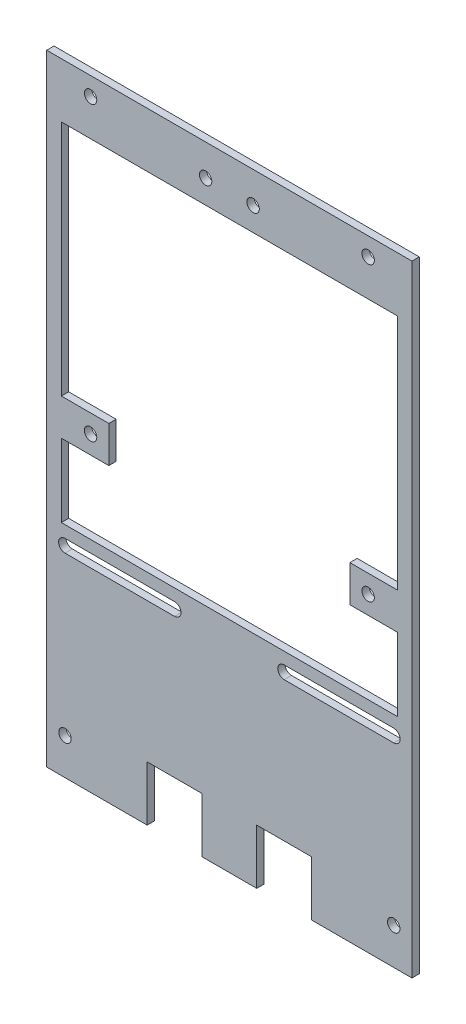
ISO-10303-21;
HEADER;
FILE_DESCRIPTION(('STEP AP214'),'2;1');
FILE_NAME('part.step','',(''),(''),'','','');
FILE_SCHEMA(('AUTOMOTIVE_DESIGN { 1 0 10303 214 1 1 1 1 }'));
ENDSEC;
DATA;
#1=APPLICATION_CONTEXT('core data for automotive mechanical design processes');
#2=APPLICATION_PROTOCOL_DEFINITION('international standard','automotive_design',2000,#1);
#3=PRODUCT_CONTEXT('',#1,'mechanical');
#4=PRODUCT('Part','Part','',(#3));
#5=PRODUCT_RELATED_PRODUCT_CATEGORY('part','',(#4));
#6=PRODUCT_DEFINITION_FORMATION('','',#4);
#7=PRODUCT_DEFINITION_CONTEXT('part definition',#1,'design');
#8=PRODUCT_DEFINITION('design','',#6,#7);
#9=PRODUCT_DEFINITION_SHAPE('','',#8);
#10=(LENGTH_UNIT() NAMED_UNIT(*) SI_UNIT(.MILLI.,.METRE.));
#11=(NAMED_UNIT(*) PLANE_ANGLE_UNIT() SI_UNIT($,.RADIAN.));
#12=(NAMED_UNIT(*) SI_UNIT($,.STERADIAN.) SOLID_ANGLE_UNIT());
#13=UNCERTAINTY_MEASURE_WITH_UNIT(LENGTH_MEASURE(1.E-05),#10,'distance_accuracy_value','');
#14=(GEOMETRIC_REPRESENTATION_CONTEXT(3) GLOBAL_UNCERTAINTY_ASSIGNED_CONTEXT((#13)) GLOBAL_UNIT_ASSIGNED_CONTEXT((#10,
#11,#12)) REPRESENTATION_CONTEXT('',''));
#15=CARTESIAN_POINT('',(0.,0.,0.));
#16=DIRECTION('',(0.,0.,1.));
#17=DIRECTION('',(1.,0.,0.));
#18=AXIS2_PLACEMENT_3D('',#15,#16,#17);
#19=CARTESIAN_POINT('',(0.,0.,2.));
#20=DIRECTION('',(0.,0.,1.));
#21=DIRECTION('',(1.,0.,0.));
#22=AXIS2_PLACEMENT_3D('',#19,#20,#21);
#23=PLANE('',#22);
#24=CARTESIAN_POINT('',(15.,-30.,2.));
#25=DIRECTION('',(0.,0.,1.));
#26=DIRECTION('',(1.,0.,0.));
#27=AXIS2_PLACEMENT_3D('',#24,#25,#26);
#28=CIRCLE('',#27,1.75);
#29=CARTESIAN_POINT('',(15.,-28.2500000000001,2.));
#30=VERTEX_POINT('',#29);
#31=CARTESIAN_POINT('',(15.,-31.75,2.));
#32=VERTEX_POINT('',#31);
#33=EDGE_CURVE('E50',#30,#32,#28,.T.);
#34=ORIENTED_EDGE('',*,*,#33,.F.);
#35=DIRECTION('',(-1.,0.,0.));
#36=VECTOR('',#35,1.);
#37=CARTESIAN_POINT('',(15.,-28.2500000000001,2.));
#38=LINE('',#37,#36);
#39=CARTESIAN_POINT('',(45.,-28.25,2.));
#40=VERTEX_POINT('',#39);
#41=EDGE_CURVE('E252',#40,#30,#38,.T.);
#42=ORIENTED_EDGE('',*,*,#41,.F.);
#43=CARTESIAN_POINT('',(45.,-30.0000000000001,2.));
#44=DIRECTION('',(0.,0.,1.));
#45=DIRECTION('',(1.,0.,0.));
#46=AXIS2_PLACEMENT_3D('',#43,#44,#45);
#47=CIRCLE('',#46,1.75);
#48=CARTESIAN_POINT('',(45.,-31.7500000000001,2.));
#49=VERTEX_POINT('',#48);
#50=EDGE_CURVE('E272',#49,#40,#47,.T.);
#51=ORIENTED_EDGE('',*,*,#50,.F.);
#52=DIRECTION('',(1.,0.,0.));
#53=VECTOR('',#52,1.);
#54=CARTESIAN_POINT('',(15.,-31.75,2.));
#55=LINE('',#54,#53);
#56=EDGE_CURVE('E266',#32,#49,#55,.T.);
#57=ORIENTED_EDGE('',*,*,#56,.F.);
#58=EDGE_LOOP('',(#34,#42,#51,#57));
#59=FACE_BOUND('',#58,.T.);
#60=CARTESIAN_POINT('',(-45.,-30.0000000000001,2.));
#61=DIRECTION('',(0.,0.,1.));
#62=DIRECTION('',(1.,0.,0.));
#63=AXIS2_PLACEMENT_3D('',#60,#61,#62);
#64=CIRCLE('',#63,1.75);
#65=CARTESIAN_POINT('',(-45.,-28.2500000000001,2.));
#66=VERTEX_POINT('',#65);
#67=CARTESIAN_POINT('',(-45.,-31.75,2.));
#68=VERTEX_POINT('',#67);
#69=EDGE_CURVE('E288',#66,#68,#64,.T.);
#70=ORIENTED_EDGE('',*,*,#69,.F.);
#71=DIRECTION('',(-1.,0.,0.));
#72=VECTOR('',#71,1.);
#73=CARTESIAN_POINT('',(-45.,-28.2500000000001,2.));
#74=LINE('',#73,#72);
#75=CARTESIAN_POINT('',(-15.,-28.25,2.));
#76=VERTEX_POINT('',#75);
#77=EDGE_CURVE('E296',#76,#66,#74,.T.);
#78=ORIENTED_EDGE('',*,*,#77,.F.);
#79=CARTESIAN_POINT('',(-15.,-30.,2.));
#80=DIRECTION('',(0.,0.,1.));
#81=DIRECTION('',(1.,0.,0.));
#82=AXIS2_PLACEMENT_3D('',#79,#80,#81);
#83=CIRCLE('',#82,1.75);
#84=CARTESIAN_POINT('',(-15.,-31.7500000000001,2.));
#85=VERTEX_POINT('',#84);
#86=EDGE_CURVE('E293',#85,#76,#83,.T.);
#87=ORIENTED_EDGE('',*,*,#86,.F.);
#88=DIRECTION('',(1.,0.,0.));
#89=VECTOR('',#88,1.);
#90=CARTESIAN_POINT('',(-45.,-31.75,2.));
#91=LINE('',#90,#89);
#92=EDGE_CURVE('E290',#68,#85,#91,.T.);
#93=ORIENTED_EDGE('',*,*,#92,.F.);
#94=EDGE_LOOP('',(#70,#78,#87,#93));
#95=FACE_BOUND('',#94,.T.);
#96=CARTESIAN_POINT('',(-38.,80.,2.));
#97=DIRECTION('',(0.,0.,1.));
#98=DIRECTION('',(1.,0.,0.));
#99=AXIS2_PLACEMENT_3D('',#96,#97,#98);
#100=CIRCLE('',#99,1.69999999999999);
#101=CARTESIAN_POINT('',(-36.3,80.,2.));
#102=VERTEX_POINT('',#101);
#103=EDGE_CURVE('E401',#102,#102,#100,.T.);
#104=ORIENTED_EDGE('',*,*,#103,.F.);
#105=EDGE_LOOP('',(#104));
#106=FACE_BOUND('',#105,.T.);
#107=CARTESIAN_POINT('',(38.,80.,2.));
#108=DIRECTION('',(0.,0.,1.));
#109=DIRECTION('',(1.,0.,0.));
#110=AXIS2_PLACEMENT_3D('',#107,#108,#109);
#111=CIRCLE('',#110,1.69999999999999);
#112=CARTESIAN_POINT('',(39.7,80.,2.));
#113=VERTEX_POINT('',#112);
#114=EDGE_CURVE('E407',#113,#113,#111,.T.);
#115=ORIENTED_EDGE('',*,*,#114,.F.);
#116=EDGE_LOOP('',(#115));
#117=FACE_BOUND('',#116,.T.);
#118=CARTESIAN_POINT('',(-38.,0.,2.));
#119=DIRECTION('',(0.,0.,1.));
#120=DIRECTION('',(1.,0.,0.));
#121=AXIS2_PLACEMENT_3D('',#118,#119,#120);
#122=CIRCLE('',#121,1.69999999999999);
#123=CARTESIAN_POINT('',(-36.3,0.,2.));
#124=VERTEX_POINT('',#123);
#125=EDGE_CURVE('E413',#124,#124,#122,.T.);
#126=ORIENTED_EDGE('',*,*,#125,.F.);
#127=EDGE_LOOP('',(#126));
#128=FACE_BOUND('',#127,.T.);
#129=CARTESIAN_POINT('',(38.,0.,2.));
#130=DIRECTION('',(0.,0.,1.));
#131=DIRECTION('',(1.,0.,0.));
#132=AXIS2_PLACEMENT_3D('',#129,#130,#131);
#133=CIRCLE('',#132,1.69999999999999);
#134=CARTESIAN_POINT('',(39.7,0.,2.));
#135=VERTEX_POINT('',#134);
#136=EDGE_CURVE('E419',#135,#135,#133,.T.);
#137=ORIENTED_EDGE('',*,*,#136,.F.);
#138=EDGE_LOOP('',(#137));
#139=FACE_BOUND('',#138,.T.);
#140=CARTESIAN_POINT('',(-45.,-75.,2.));
#141=DIRECTION('',(0.,0.,1.));
#142=DIRECTION('',(1.,0.,0.));
#143=AXIS2_PLACEMENT_3D('',#140,#141,#142);
#144=CIRCLE('',#143,1.69999999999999);
#145=CARTESIAN_POINT('',(-43.3,-75.,2.));
#146=VERTEX_POINT('',#145);
#147=EDGE_CURVE('E425',#146,#146,#144,.T.);
#148=ORIENTED_EDGE('',*,*,#147,.F.);
#149=EDGE_LOOP('',(#148));
#150=FACE_BOUND('',#149,.T.);
#151=CARTESIAN_POINT('',(45.,-75.,2.));
#152=DIRECTION('',(0.,0.,1.));
#153=DIRECTION('',(1.,0.,0.));
#154=AXIS2_PLACEMENT_3D('',#151,#152,#153);
#155=CIRCLE('',#154,1.69999999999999);
#156=CARTESIAN_POINT('',(46.7,-75.,2.));
#157=VERTEX_POINT('',#156);
#158=EDGE_CURVE('E431',#157,#157,#155,.T.);
#159=ORIENTED_EDGE('',*,*,#158,.F.);
#160=EDGE_LOOP('',(#159));
#161=FACE_BOUND('',#160,.T.);
#162=CARTESIAN_POINT('',(-6.49999121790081,76.4436388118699,2.));
#163=DIRECTION('',(0.,0.,1.));
#164=DIRECTION('',(1.,0.,0.));
#165=AXIS2_PLACEMENT_3D('',#162,#163,#164);
#166=CIRCLE('',#165,1.69999999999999);
#167=CARTESIAN_POINT('',(-4.79999121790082,76.4436388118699,2.));
#168=VERTEX_POINT('',#167);
#169=EDGE_CURVE('E437',#168,#168,#166,.T.);
#170=ORIENTED_EDGE('',*,*,#169,.F.);
#171=EDGE_LOOP('',(#170));
#172=FACE_BOUND('',#171,.T.);
#173=CARTESIAN_POINT('',(6.50000878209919,76.4436388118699,2.));
#174=DIRECTION('',(0.,0.,1.));
#175=DIRECTION('',(1.,0.,0.));
#176=AXIS2_PLACEMENT_3D('',#173,#174,#175);
#177=CIRCLE('',#176,1.69999999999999);
#178=CARTESIAN_POINT('',(8.20000878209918,76.4436388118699,2.));
#179=VERTEX_POINT('',#178);
#180=EDGE_CURVE('E443',#179,#179,#177,.T.);
#181=ORIENTED_EDGE('',*,*,#180,.F.);
#182=EDGE_LOOP('',(#181));
#183=FACE_BOUND('',#182,.T.);
#184=DIRECTION('',(0.,1.,0.));
#185=VECTOR('',#184,1.);
#186=CARTESIAN_POINT('',(22.5,-100.,2.));
#187=LINE('',#186,#185);
#188=CARTESIAN_POINT('',(22.5,-85.,2.));
#189=VERTEX_POINT('',#188);
#190=CARTESIAN_POINT('',(22.5,-70.,2.));
#191=VERTEX_POINT('',#190);
#192=EDGE_CURVE('E449',#189,#191,#187,.T.);
#193=ORIENTED_EDGE('',*,*,#192,.F.);
#194=DIRECTION('',(1.,0.,0.));
#195=VECTOR('',#194,1.);
#196=CARTESIAN_POINT('',(-50.,-85.,2.));
#197=LINE('',#196,#195);
#198=CARTESIAN_POINT('',(50.,-85.,2.));
#199=VERTEX_POINT('',#198);
#200=EDGE_CURVE('E494',#189,#199,#197,.T.);
#201=ORIENTED_EDGE('',*,*,#200,.T.);
#202=DIRECTION('',(0.,1.,0.));
#203=VECTOR('',#202,1.);
#204=CARTESIAN_POINT('',(50.,85.,2.));
#205=LINE('',#204,#203);
#206=CARTESIAN_POINT('',(50.,85.,2.));
#207=VERTEX_POINT('',#206);
#208=EDGE_CURVE('E486',#199,#207,#205,.T.);
#209=ORIENTED_EDGE('',*,*,#208,.T.);
#210=DIRECTION('',(-1.,0.,0.));
#211=VECTOR('',#210,1.);
#212=CARTESIAN_POINT('',(-50.,85.,2.));
#213=LINE('',#212,#211);
#214=CARTESIAN_POINT('',(-50.,85.,2.));
#215=VERTEX_POINT('',#214);
#216=EDGE_CURVE('E489',#207,#215,#213,.T.);
#217=ORIENTED_EDGE('',*,*,#216,.T.);
#218=DIRECTION('',(0.,-1.,0.));
#219=VECTOR('',#218,1.);
#220=CARTESIAN_POINT('',(-50.,85.,2.));
#221=LINE('',#220,#219);
#222=CARTESIAN_POINT('',(-50.,-85.,2.));
#223=VERTEX_POINT('',#222);
#224=EDGE_CURVE('E492',#215,#223,#221,.T.);
#225=ORIENTED_EDGE('',*,*,#224,.T.);
#226=CARTESIAN_POINT('',(-22.5,-85.,2.));
#227=VERTEX_POINT('',#226);
#228=EDGE_CURVE('E495',#223,#227,#197,.T.);
#229=ORIENTED_EDGE('',*,*,#228,.T.);
#230=DIRECTION('',(0.,-1.,0.));
#231=VECTOR('',#230,1.);
#232=CARTESIAN_POINT('',(-22.5,-100.,2.));
#233=LINE('',#232,#231);
#234=CARTESIAN_POINT('',(-22.5,-70.,2.));
#235=VERTEX_POINT('',#234);
#236=EDGE_CURVE('E472',#235,#227,#233,.T.);
#237=ORIENTED_EDGE('',*,*,#236,.F.);
#238=DIRECTION('',(-1.,0.,0.));
#239=VECTOR('',#238,1.);
#240=CARTESIAN_POINT('',(-22.5,-70.,2.));
#241=LINE('',#240,#239);
#242=CARTESIAN_POINT('',(-7.5,-70.,2.));
#243=VERTEX_POINT('',#242);
#244=EDGE_CURVE('E469',#243,#235,#241,.T.);
#245=ORIENTED_EDGE('',*,*,#244,.F.);
#246=DIRECTION('',(0.,1.,0.));
#247=VECTOR('',#246,1.);
#248=CARTESIAN_POINT('',(-7.5,-100.,2.));
#249=LINE('',#248,#247);
#250=CARTESIAN_POINT('',(-7.5,-85.,2.));
#251=VERTEX_POINT('',#250);
#252=EDGE_CURVE('E467',#251,#243,#249,.T.);
#253=ORIENTED_EDGE('',*,*,#252,.F.);
#254=CARTESIAN_POINT('',(7.5,-85.,2.));
#255=VERTEX_POINT('',#254);
#256=EDGE_CURVE('E499',#251,#255,#197,.T.);
#257=ORIENTED_EDGE('',*,*,#256,.T.);
#258=DIRECTION('',(0.,-1.,0.));
#259=VECTOR('',#258,1.);
#260=CARTESIAN_POINT('',(7.5,-100.,2.));
#261=LINE('',#260,#259);
#262=CARTESIAN_POINT('',(7.5,-70.,2.));
#263=VERTEX_POINT('',#262);
#264=EDGE_CURVE('E454',#263,#255,#261,.T.);
#265=ORIENTED_EDGE('',*,*,#264,.F.);
#266=DIRECTION('',(-1.,0.,0.));
#267=VECTOR('',#266,1.);
#268=CARTESIAN_POINT('',(7.5,-70.,2.));
#269=LINE('',#268,#267);
#270=EDGE_CURVE('E451',#191,#263,#269,.T.);
#271=ORIENTED_EDGE('',*,*,#270,.F.);
#272=EDGE_LOOP('',(#193,#201,#209,#217,#225,#229,#237,#245,#253,#257,#265,#271));
#273=FACE_BOUND('',#272,.T.);
#274=DIRECTION('',(1.,0.,0.));
#275=VECTOR('',#274,1.);
#276=CARTESIAN_POINT('',(0.,70.,2.));
#277=LINE('',#276,#275);
#278=CARTESIAN_POINT('',(-46.,70.,2.));
#279=VERTEX_POINT('',#278);
#280=CARTESIAN_POINT('',(46.,70.,2.));
#281=VERTEX_POINT('',#280);
#282=EDGE_CURVE('E342',#279,#281,#277,.T.);
#283=ORIENTED_EDGE('',*,*,#282,.T.);
#284=DIRECTION('',(0.,-1.,0.));
#285=VECTOR('',#284,1.);
#286=CARTESIAN_POINT('',(46.,0.,2.));
#287=LINE('',#286,#285);
#288=CARTESIAN_POINT('',(46.,4.99999999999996,2.));
#289=VERTEX_POINT('',#288);
#290=EDGE_CURVE('E339',#281,#289,#287,.T.);
#291=ORIENTED_EDGE('',*,*,#290,.T.);
#292=DIRECTION('',(1.,0.,0.));
#293=VECTOR('',#292,1.);
#294=CARTESIAN_POINT('',(0.,4.99999999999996,2.));
#295=LINE('',#294,#293);
#296=CARTESIAN_POINT('',(33.,4.99999999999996,2.));
#297=VERTEX_POINT('',#296);
#298=EDGE_CURVE('E352',#297,#289,#295,.T.);
#299=ORIENTED_EDGE('',*,*,#298,.F.);
#300=DIRECTION('',(0.,-1.,0.));
#301=VECTOR('',#300,1.);
#302=CARTESIAN_POINT('',(33.,0.,2.));
#303=LINE('',#302,#301);
#304=CARTESIAN_POINT('',(33.,-5.00000000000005,2.));
#305=VERTEX_POINT('',#304);
#306=EDGE_CURVE('E370',#297,#305,#303,.T.);
#307=ORIENTED_EDGE('',*,*,#306,.T.);
#308=DIRECTION('',(1.,0.,0.));
#309=VECTOR('',#308,1.);
#310=CARTESIAN_POINT('',(0.,-5.00000000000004,2.));
#311=LINE('',#310,#309);
#312=CARTESIAN_POINT('',(46.,-5.00000000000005,2.));
#313=VERTEX_POINT('',#312);
#314=EDGE_CURVE('E367',#305,#313,#311,.T.);
#315=ORIENTED_EDGE('',*,*,#314,.T.);
#316=DIRECTION('',(0.,-1.,0.));
#317=VECTOR('',#316,1.);
#318=CARTESIAN_POINT('',(46.,0.,2.));
#319=LINE('',#318,#317);
#320=CARTESIAN_POINT('',(46.,-25.,2.));
#321=VERTEX_POINT('',#320);
#322=EDGE_CURVE('E364',#313,#321,#319,.T.);
#323=ORIENTED_EDGE('',*,*,#322,.T.);
#324=DIRECTION('',(1.,0.,0.));
#325=VECTOR('',#324,1.);
#326=CARTESIAN_POINT('',(0.,-25.,2.));
#327=LINE('',#326,#325);
#328=CARTESIAN_POINT('',(-46.,-25.,2.));
#329=VERTEX_POINT('',#328);
#330=EDGE_CURVE('E361',#329,#321,#327,.T.);
#331=ORIENTED_EDGE('',*,*,#330,.F.);
#332=DIRECTION('',(0.,-1.,0.));
#333=VECTOR('',#332,1.);
#334=CARTESIAN_POINT('',(-46.,0.,2.));
#335=LINE('',#334,#333);
#336=CARTESIAN_POINT('',(-46.,-5.00000000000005,2.));
#337=VERTEX_POINT('',#336);
#338=EDGE_CURVE('E358',#337,#329,#335,.T.);
#339=ORIENTED_EDGE('',*,*,#338,.F.);
#340=DIRECTION('',(1.,0.,0.));
#341=VECTOR('',#340,1.);
#342=CARTESIAN_POINT('',(0.,-5.00000000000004,2.));
#343=LINE('',#342,#341);
#344=CARTESIAN_POINT('',(-33.,-5.00000000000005,2.));
#345=VERTEX_POINT('',#344);
#346=EDGE_CURVE('E355',#337,#345,#343,.T.);
#347=ORIENTED_EDGE('',*,*,#346,.T.);
#348=DIRECTION('',(0.,-1.,0.));
#349=VECTOR('',#348,1.);
#350=CARTESIAN_POINT('',(-33.,0.,2.));
#351=LINE('',#350,#349);
#352=CARTESIAN_POINT('',(-33.,4.99999999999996,2.));
#353=VERTEX_POINT('',#352);
#354=EDGE_CURVE('E351',#353,#345,#351,.T.);
#355=ORIENTED_EDGE('',*,*,#354,.F.);
#356=CARTESIAN_POINT('',(-46.,4.99999999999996,2.));
#357=VERTEX_POINT('',#356);
#358=EDGE_CURVE('E348',#357,#353,#295,.T.);
#359=ORIENTED_EDGE('',*,*,#358,.F.);
#360=DIRECTION('',(0.,-1.,0.));
#361=VECTOR('',#360,1.);
#362=CARTESIAN_POINT('',(-46.,0.,2.));
#363=LINE('',#362,#361);
#364=EDGE_CURVE('E345',#279,#357,#363,.T.);
#365=ORIENTED_EDGE('',*,*,#364,.F.);
#366=EDGE_LOOP('',(#283,#291,#299,#307,#315,#323,#331,#339,#347,#355,#359,#365));
#367=FACE_BOUND('',#366,.T.);
#368=ADVANCED_FACE('F35',(#59,#95,#106,#117,#128,#139,#150,#161,#172,#183,#273,#367),#23,.T.);
#369=CARTESIAN_POINT('',(0.,0.,0.));
#370=DIRECTION('',(0.,0.,1.));
#371=DIRECTION('',(1.,0.,0.));
#372=AXIS2_PLACEMENT_3D('',#369,#370,#371);
#373=PLANE('',#372);
#374=DIRECTION('',(1.,0.,0.));
#375=VECTOR('',#374,1.);
#376=CARTESIAN_POINT('',(15.,-28.2500000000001,0.));
#377=LINE('',#376,#375);
#378=CARTESIAN_POINT('',(15.,-28.2500000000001,0.));
#379=VERTEX_POINT('',#378);
#380=CARTESIAN_POINT('',(45.,-28.25,0.));
#381=VERTEX_POINT('',#380);
#382=EDGE_CURVE('E264',#379,#381,#377,.T.);
#383=ORIENTED_EDGE('',*,*,#382,.F.);
#384=CARTESIAN_POINT('',(15.,-30.,0.));
#385=DIRECTION('',(0.,0.,1.));
#386=DIRECTION('',(1.,0.,0.));
#387=AXIS2_PLACEMENT_3D('',#384,#385,#386);
#388=CIRCLE('',#387,1.75);
#389=CARTESIAN_POINT('',(15.,-31.75,0.));
#390=VERTEX_POINT('',#389);
#391=EDGE_CURVE('E246',#390,#379,#388,.F.);
#392=ORIENTED_EDGE('',*,*,#391,.F.);
#393=DIRECTION('',(-1.,0.,0.));
#394=VECTOR('',#393,1.);
#395=CARTESIAN_POINT('',(15.,-31.75,0.));
#396=LINE('',#395,#394);
#397=CARTESIAN_POINT('',(45.,-31.7500000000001,0.));
#398=VERTEX_POINT('',#397);
#399=EDGE_CURVE('E255',#398,#390,#396,.T.);
#400=ORIENTED_EDGE('',*,*,#399,.F.);
#401=CARTESIAN_POINT('',(45.,-30.0000000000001,0.));
#402=DIRECTION('',(0.,0.,1.));
#403=DIRECTION('',(1.,0.,0.));
#404=AXIS2_PLACEMENT_3D('',#401,#402,#403);
#405=CIRCLE('',#404,1.75);
#406=EDGE_CURVE('E58',#381,#398,#405,.F.);
#407=ORIENTED_EDGE('',*,*,#406,.F.);
#408=EDGE_LOOP('',(#383,#392,#400,#407));
#409=FACE_BOUND('',#408,.T.);
#410=DIRECTION('',(1.,0.,0.));
#411=VECTOR('',#410,1.);
#412=CARTESIAN_POINT('',(-45.,-28.2500000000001,0.));
#413=LINE('',#412,#411);
#414=CARTESIAN_POINT('',(-45.,-28.2500000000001,0.));
#415=VERTEX_POINT('',#414);
#416=CARTESIAN_POINT('',(-15.,-28.25,0.));
#417=VERTEX_POINT('',#416);
#418=EDGE_CURVE('E282',#415,#417,#413,.T.);
#419=ORIENTED_EDGE('',*,*,#418,.F.);
#420=CARTESIAN_POINT('',(-45.,-30.0000000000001,0.));
#421=DIRECTION('',(0.,0.,1.));
#422=DIRECTION('',(1.,0.,0.));
#423=AXIS2_PLACEMENT_3D('',#420,#421,#422);
#424=CIRCLE('',#423,1.75);
#425=CARTESIAN_POINT('',(-45.,-31.75,0.));
#426=VERTEX_POINT('',#425);
#427=EDGE_CURVE('E285',#426,#415,#424,.F.);
#428=ORIENTED_EDGE('',*,*,#427,.F.);
#429=DIRECTION('',(-1.,0.,0.));
#430=VECTOR('',#429,1.);
#431=CARTESIAN_POINT('',(-45.,-31.75,0.));
#432=LINE('',#431,#430);
#433=CARTESIAN_POINT('',(-15.,-31.7500000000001,0.));
#434=VERTEX_POINT('',#433);
#435=EDGE_CURVE('E302',#434,#426,#432,.T.);
#436=ORIENTED_EDGE('',*,*,#435,.F.);
#437=CARTESIAN_POINT('',(-15.,-30.,0.));
#438=DIRECTION('',(0.,0.,1.));
#439=DIRECTION('',(1.,0.,0.));
#440=AXIS2_PLACEMENT_3D('',#437,#438,#439);
#441=CIRCLE('',#440,1.75);
#442=EDGE_CURVE('E258',#417,#434,#441,.F.);
#443=ORIENTED_EDGE('',*,*,#442,.F.);
#444=EDGE_LOOP('',(#419,#428,#436,#443));
#445=FACE_BOUND('',#444,.T.);
#446=DIRECTION('',(1.,0.,0.));
#447=VECTOR('',#446,1.);
#448=CARTESIAN_POINT('',(-50.,-85.,0.));
#449=LINE('',#448,#447);
#450=CARTESIAN_POINT('',(22.5,-85.,0.));
#451=VERTEX_POINT('',#450);
#452=CARTESIAN_POINT('',(50.,-85.,0.));
#453=VERTEX_POINT('',#452);
#454=EDGE_CURVE('E506',#451,#453,#449,.T.);
#455=ORIENTED_EDGE('',*,*,#454,.F.);
#456=DIRECTION('',(0.,1.,0.));
#457=VECTOR('',#456,1.);
#458=CARTESIAN_POINT('',(22.5,0.,0.));
#459=LINE('',#458,#457);
#460=CARTESIAN_POINT('',(22.5,-70.,0.));
#461=VERTEX_POINT('',#460);
#462=EDGE_CURVE('E11',#451,#461,#459,.T.);
#463=ORIENTED_EDGE('',*,*,#462,.T.);
#464=DIRECTION('',(-1.,0.,0.));
#465=VECTOR('',#464,1.);
#466=CARTESIAN_POINT('',(0.,-70.,0.));
#467=LINE('',#466,#465);
#468=CARTESIAN_POINT('',(7.5,-70.,0.));
#469=VERTEX_POINT('',#468);
#470=EDGE_CURVE('E530',#461,#469,#467,.T.);
#471=ORIENTED_EDGE('',*,*,#470,.T.);
#472=DIRECTION('',(0.,-1.,0.));
#473=VECTOR('',#472,1.);
#474=CARTESIAN_POINT('',(7.5,0.,0.));
#475=LINE('',#474,#473);
#476=CARTESIAN_POINT('',(7.5,-85.,0.));
#477=VERTEX_POINT('',#476);
#478=EDGE_CURVE('E43',#469,#477,#475,.T.);
#479=ORIENTED_EDGE('',*,*,#478,.T.);
#480=CARTESIAN_POINT('',(-7.5,-85.,0.));
#481=VERTEX_POINT('',#480);
#482=EDGE_CURVE('E509',#481,#477,#449,.T.);
#483=ORIENTED_EDGE('',*,*,#482,.F.);
#484=DIRECTION('',(0.,1.,0.));
#485=VECTOR('',#484,1.);
#486=CARTESIAN_POINT('',(-7.5,0.,0.));
#487=LINE('',#486,#485);
#488=CARTESIAN_POINT('',(-7.5,-70.,0.));
#489=VERTEX_POINT('',#488);
#490=EDGE_CURVE('E527',#481,#489,#487,.T.);
#491=ORIENTED_EDGE('',*,*,#490,.T.);
#492=DIRECTION('',(-1.,0.,0.));
#493=VECTOR('',#492,1.);
#494=CARTESIAN_POINT('',(0.,-70.,0.));
#495=LINE('',#494,#493);
#496=CARTESIAN_POINT('',(-22.5,-70.,0.));
#497=VERTEX_POINT('',#496);
#498=EDGE_CURVE('E521',#489,#497,#495,.T.);
#499=ORIENTED_EDGE('',*,*,#498,.T.);
#500=DIRECTION('',(0.,-1.,0.));
#501=VECTOR('',#500,1.);
#502=CARTESIAN_POINT('',(-22.5,0.,0.));
#503=LINE('',#502,#501);
#504=CARTESIAN_POINT('',(-22.5,-85.,0.));
#505=VERTEX_POINT('',#504);
#506=EDGE_CURVE('E524',#497,#505,#503,.T.);
#507=ORIENTED_EDGE('',*,*,#506,.T.);
#508=CARTESIAN_POINT('',(-50.,-85.,0.));
#509=VERTEX_POINT('',#508);
#510=EDGE_CURVE('E490',#509,#505,#449,.T.);
#511=ORIENTED_EDGE('',*,*,#510,.F.);
#512=DIRECTION('',(0.,-1.,0.));
#513=VECTOR('',#512,1.);
#514=CARTESIAN_POINT('',(-50.,85.,0.));
#515=LINE('',#514,#513);
#516=CARTESIAN_POINT('',(-50.,85.,0.));
#517=VERTEX_POINT('',#516);
#518=EDGE_CURVE('E504',#517,#509,#515,.T.);
#519=ORIENTED_EDGE('',*,*,#518,.F.);
#520=DIRECTION('',(-1.,0.,0.));
#521=VECTOR('',#520,1.);
#522=CARTESIAN_POINT('',(-50.,85.,0.));
#523=LINE('',#522,#521);
#524=CARTESIAN_POINT('',(50.,85.,0.));
#525=VERTEX_POINT('',#524);
#526=EDGE_CURVE('E502',#525,#517,#523,.T.);
#527=ORIENTED_EDGE('',*,*,#526,.F.);
#528=DIRECTION('',(0.,1.,0.));
#529=VECTOR('',#528,1.);
#530=CARTESIAN_POINT('',(50.,85.,0.));
#531=LINE('',#530,#529);
#532=EDGE_CURVE('E485',#453,#525,#531,.T.);
#533=ORIENTED_EDGE('',*,*,#532,.F.);
#534=EDGE_LOOP('',(#455,#463,#471,#479,#483,#491,#499,#507,#511,#519,#527,#533));
#535=FACE_BOUND('',#534,.T.);
#536=CARTESIAN_POINT('',(6.50000878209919,76.4436388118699,0.));
#537=DIRECTION('',(0.,0.,1.));
#538=DIRECTION('',(1.,0.,0.));
#539=AXIS2_PLACEMENT_3D('',#536,#537,#538);
#540=CIRCLE('',#539,1.7);
#541=CARTESIAN_POINT('',(8.20000878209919,76.4436388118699,0.));
#542=VERTEX_POINT('',#541);
#543=EDGE_CURVE('E446',#542,#542,#540,.T.);
#544=ORIENTED_EDGE('',*,*,#543,.T.);
#545=EDGE_LOOP('',(#544));
#546=FACE_BOUND('',#545,.T.);
#547=CARTESIAN_POINT('',(-6.49999121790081,76.4436388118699,0.));
#548=DIRECTION('',(0.,0.,1.));
#549=DIRECTION('',(1.,0.,0.));
#550=AXIS2_PLACEMENT_3D('',#547,#548,#549);
#551=CIRCLE('',#550,1.7);
#552=CARTESIAN_POINT('',(-4.79999121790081,76.4436388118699,0.));
#553=VERTEX_POINT('',#552);
#554=EDGE_CURVE('E440',#553,#553,#551,.T.);
#555=ORIENTED_EDGE('',*,*,#554,.T.);
#556=EDGE_LOOP('',(#555));
#557=FACE_BOUND('',#556,.T.);
#558=CARTESIAN_POINT('',(45.,-75.,0.));
#559=DIRECTION('',(0.,0.,1.));
#560=DIRECTION('',(1.,0.,0.));
#561=AXIS2_PLACEMENT_3D('',#558,#559,#560);
#562=CIRCLE('',#561,1.7);
#563=CARTESIAN_POINT('',(46.7,-75.,0.));
#564=VERTEX_POINT('',#563);
#565=EDGE_CURVE('E434',#564,#564,#562,.T.);
#566=ORIENTED_EDGE('',*,*,#565,.T.);
#567=EDGE_LOOP('',(#566));
#568=FACE_BOUND('',#567,.T.);
#569=CARTESIAN_POINT('',(-45.,-75.,0.));
#570=DIRECTION('',(0.,0.,1.));
#571=DIRECTION('',(1.,0.,0.));
#572=AXIS2_PLACEMENT_3D('',#569,#570,#571);
#573=CIRCLE('',#572,1.7);
#574=CARTESIAN_POINT('',(-43.3,-75.,0.));
#575=VERTEX_POINT('',#574);
#576=EDGE_CURVE('E428',#575,#575,#573,.T.);
#577=ORIENTED_EDGE('',*,*,#576,.T.);
#578=EDGE_LOOP('',(#577));
#579=FACE_BOUND('',#578,.T.);
#580=CARTESIAN_POINT('',(38.,0.,0.));
#581=DIRECTION('',(0.,0.,1.));
#582=DIRECTION('',(1.,0.,0.));
#583=AXIS2_PLACEMENT_3D('',#580,#581,#582);
#584=CIRCLE('',#583,1.7);
#585=CARTESIAN_POINT('',(39.7,0.,0.));
#586=VERTEX_POINT('',#585);
#587=EDGE_CURVE('E422',#586,#586,#584,.T.);
#588=ORIENTED_EDGE('',*,*,#587,.T.);
#589=EDGE_LOOP('',(#588));
#590=FACE_BOUND('',#589,.T.);
#591=CARTESIAN_POINT('',(-38.,0.,0.));
#592=DIRECTION('',(0.,0.,1.));
#593=DIRECTION('',(1.,0.,0.));
#594=AXIS2_PLACEMENT_3D('',#591,#592,#593);
#595=CIRCLE('',#594,1.7);
#596=CARTESIAN_POINT('',(-36.3,0.,0.));
#597=VERTEX_POINT('',#596);
#598=EDGE_CURVE('E416',#597,#597,#595,.T.);
#599=ORIENTED_EDGE('',*,*,#598,.T.);
#600=EDGE_LOOP('',(#599));
#601=FACE_BOUND('',#600,.T.);
#602=CARTESIAN_POINT('',(38.,80.,0.));
#603=DIRECTION('',(0.,0.,1.));
#604=DIRECTION('',(1.,0.,0.));
#605=AXIS2_PLACEMENT_3D('',#602,#603,#604);
#606=CIRCLE('',#605,1.7);
#607=CARTESIAN_POINT('',(39.7,80.,0.));
#608=VERTEX_POINT('',#607);
#609=EDGE_CURVE('E410',#608,#608,#606,.T.);
#610=ORIENTED_EDGE('',*,*,#609,.T.);
#611=EDGE_LOOP('',(#610));
#612=FACE_BOUND('',#611,.T.);
#613=CARTESIAN_POINT('',(-38.,80.,0.));
#614=DIRECTION('',(0.,0.,1.));
#615=DIRECTION('',(1.,0.,0.));
#616=AXIS2_PLACEMENT_3D('',#613,#614,#615);
#617=CIRCLE('',#616,1.7);
#618=CARTESIAN_POINT('',(-36.3,80.,0.));
#619=VERTEX_POINT('',#618);
#620=EDGE_CURVE('E404',#619,#619,#617,.T.);
#621=ORIENTED_EDGE('',*,*,#620,.T.);
#622=EDGE_LOOP('',(#621));
#623=FACE_BOUND('',#622,.T.);
#624=DIRECTION('',(0.,1.,0.));
#625=VECTOR('',#624,1.);
#626=CARTESIAN_POINT('',(46.,0.,0.));
#627=LINE('',#626,#625);
#628=CARTESIAN_POINT('',(46.,4.99999999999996,0.));
#629=VERTEX_POINT('',#628);
#630=CARTESIAN_POINT('',(46.,70.,0.));
#631=VERTEX_POINT('',#630);
#632=EDGE_CURVE('E336',#629,#631,#627,.T.);
#633=ORIENTED_EDGE('',*,*,#632,.T.);
#634=DIRECTION('',(-1.,0.,0.));
#635=VECTOR('',#634,1.);
#636=CARTESIAN_POINT('',(0.,70.,0.));
#637=LINE('',#636,#635);
#638=CARTESIAN_POINT('',(-46.,70.,0.));
#639=VERTEX_POINT('',#638);
#640=EDGE_CURVE('E375',#631,#639,#637,.T.);
#641=ORIENTED_EDGE('',*,*,#640,.T.);
#642=DIRECTION('',(0.,1.,0.));
#643=VECTOR('',#642,1.);
#644=CARTESIAN_POINT('',(-46.,0.,0.));
#645=LINE('',#644,#643);
#646=CARTESIAN_POINT('',(-46.,4.99999999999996,0.));
#647=VERTEX_POINT('',#646);
#648=EDGE_CURVE('E311',#647,#639,#645,.T.);
#649=ORIENTED_EDGE('',*,*,#648,.F.);
#650=DIRECTION('',(-1.,0.,0.));
#651=VECTOR('',#650,1.);
#652=CARTESIAN_POINT('',(0.,4.99999999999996,0.));
#653=LINE('',#652,#651);
#654=CARTESIAN_POINT('',(-33.,4.99999999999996,0.));
#655=VERTEX_POINT('',#654);
#656=EDGE_CURVE('E314',#655,#647,#653,.T.);
#657=ORIENTED_EDGE('',*,*,#656,.F.);
#658=DIRECTION('',(0.,1.,0.));
#659=VECTOR('',#658,1.);
#660=CARTESIAN_POINT('',(-33.,0.,0.));
#661=LINE('',#660,#659);
#662=CARTESIAN_POINT('',(-33.,-5.00000000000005,0.));
#663=VERTEX_POINT('',#662);
#664=EDGE_CURVE('E316',#663,#655,#661,.T.);
#665=ORIENTED_EDGE('',*,*,#664,.F.);
#666=DIRECTION('',(-1.,0.,0.));
#667=VECTOR('',#666,1.);
#668=CARTESIAN_POINT('',(0.,-5.00000000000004,0.));
#669=LINE('',#668,#667);
#670=CARTESIAN_POINT('',(-46.,-5.00000000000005,0.));
#671=VERTEX_POINT('',#670);
#672=EDGE_CURVE('E318',#663,#671,#669,.T.);
#673=ORIENTED_EDGE('',*,*,#672,.T.);
#674=DIRECTION('',(0.,1.,0.));
#675=VECTOR('',#674,1.);
#676=CARTESIAN_POINT('',(-46.,0.,0.));
#677=LINE('',#676,#675);
#678=CARTESIAN_POINT('',(-46.,-25.,0.));
#679=VERTEX_POINT('',#678);
#680=EDGE_CURVE('E321',#679,#671,#677,.T.);
#681=ORIENTED_EDGE('',*,*,#680,.F.);
#682=DIRECTION('',(-1.,0.,0.));
#683=VECTOR('',#682,1.);
#684=CARTESIAN_POINT('',(0.,-25.,0.));
#685=LINE('',#684,#683);
#686=CARTESIAN_POINT('',(46.,-25.,0.));
#687=VERTEX_POINT('',#686);
#688=EDGE_CURVE('E323',#687,#679,#685,.T.);
#689=ORIENTED_EDGE('',*,*,#688,.F.);
#690=DIRECTION('',(0.,1.,0.));
#691=VECTOR('',#690,1.);
#692=CARTESIAN_POINT('',(46.,0.,0.));
#693=LINE('',#692,#691);
#694=CARTESIAN_POINT('',(46.,-5.00000000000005,0.));
#695=VERTEX_POINT('',#694);
#696=EDGE_CURVE('E325',#687,#695,#693,.T.);
#697=ORIENTED_EDGE('',*,*,#696,.T.);
#698=DIRECTION('',(-1.,0.,0.));
#699=VECTOR('',#698,1.);
#700=CARTESIAN_POINT('',(0.,-5.00000000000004,0.));
#701=LINE('',#700,#699);
#702=CARTESIAN_POINT('',(33.,-5.00000000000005,0.));
#703=VERTEX_POINT('',#702);
#704=EDGE_CURVE('E328',#695,#703,#701,.T.);
#705=ORIENTED_EDGE('',*,*,#704,.T.);
#706=DIRECTION('',(0.,1.,0.));
#707=VECTOR('',#706,1.);
#708=CARTESIAN_POINT('',(33.,0.,0.));
#709=LINE('',#708,#707);
#710=CARTESIAN_POINT('',(33.,4.99999999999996,0.));
#711=VERTEX_POINT('',#710);
#712=EDGE_CURVE('E331',#703,#711,#709,.T.);
#713=ORIENTED_EDGE('',*,*,#712,.T.);
#714=DIRECTION('',(-1.,0.,0.));
#715=VECTOR('',#714,1.);
#716=CARTESIAN_POINT('',(0.,4.99999999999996,0.));
#717=LINE('',#716,#715);
#718=EDGE_CURVE('E334',#629,#711,#717,.T.);
#719=ORIENTED_EDGE('',*,*,#718,.F.);
#720=EDGE_LOOP('',(#633,#641,#649,#657,#665,#673,#681,#689,#697,#705,#713,#719));
#721=FACE_BOUND('',#720,.T.);
#722=ADVANCED_FACE('F261',(#409,#445,#535,#546,#557,#568,#579,#590,#601,#612,#623,#721),#373,.F.);
#723=CARTESIAN_POINT('',(-50.,-85.,2.));
#724=DIRECTION('',(0.,1.,0.));
#725=DIRECTION('',(0.,0.,1.));
#726=AXIS2_PLACEMENT_3D('',#723,#724,#725);
#727=PLANE('',#726);
#728=ORIENTED_EDGE('',*,*,#200,.F.);
#729=DIRECTION('',(0.,0.,-1.));
#730=VECTOR('',#729,1.);
#731=CARTESIAN_POINT('',(22.5,-85.,2.));
#732=LINE('',#731,#730);
#733=EDGE_CURVE('E464',#189,#451,#732,.T.);
#734=ORIENTED_EDGE('',*,*,#733,.T.);
#735=ORIENTED_EDGE('',*,*,#454,.T.);
#736=DIRECTION('',(0.,0.,-1.));
#737=VECTOR('',#736,1.);
#738=CARTESIAN_POINT('',(50.,-85.,2.));
#739=LINE('',#738,#737);
#740=EDGE_CURVE('E498',#199,#453,#739,.T.);
#741=ORIENTED_EDGE('',*,*,#740,.F.);
#742=EDGE_LOOP('',(#728,#734,#735,#741));
#743=FACE_BOUND('',#742,.T.);
#744=ADVANCED_FACE('F547',(#743),#727,.F.);
#745=ORIENTED_EDGE('',*,*,#482,.T.);
#746=DIRECTION('',(0.,0.,1.));
#747=VECTOR('',#746,1.);
#748=CARTESIAN_POINT('',(7.49999999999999,-85.,2.));
#749=LINE('',#748,#747);
#750=EDGE_CURVE('E459',#477,#255,#749,.T.);
#751=ORIENTED_EDGE('',*,*,#750,.T.);
#752=ORIENTED_EDGE('',*,*,#256,.F.);
#753=DIRECTION('',(0.,0.,-1.));
#754=VECTOR('',#753,1.);
#755=CARTESIAN_POINT('',(-7.50000000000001,-85.,2.));
#756=LINE('',#755,#754);
#757=EDGE_CURVE('E482',#251,#481,#756,.T.);
#758=ORIENTED_EDGE('',*,*,#757,.T.);
#759=EDGE_LOOP('',(#745,#751,#752,#758));
#760=FACE_BOUND('',#759,.T.);
#761=ADVANCED_FACE('F541',(#760),#727,.F.);
#762=CARTESIAN_POINT('',(50.,85.,2.));
#763=DIRECTION('',(-1.,0.,0.));
#764=DIRECTION('',(0.,-1.,0.));
#765=AXIS2_PLACEMENT_3D('',#762,#763,#764);
#766=PLANE('',#765);
#767=ORIENTED_EDGE('',*,*,#532,.T.);
#768=DIRECTION('',(0.,0.,-1.));
#769=VECTOR('',#768,1.);
#770=CARTESIAN_POINT('',(50.,85.,2.));
#771=LINE('',#770,#769);
#772=EDGE_CURVE('E518',#207,#525,#771,.T.);
#773=ORIENTED_EDGE('',*,*,#772,.F.);
#774=ORIENTED_EDGE('',*,*,#208,.F.);
#775=ORIENTED_EDGE('',*,*,#740,.T.);
#776=EDGE_LOOP('',(#767,#773,#774,#775));
#777=FACE_BOUND('',#776,.T.);
#778=ADVANCED_FACE('F37',(#777),#766,.F.);
#779=CARTESIAN_POINT('',(-50.,85.,2.));
#780=DIRECTION('',(0.,-1.,0.));
#781=DIRECTION('',(0.,0.,-1.));
#782=AXIS2_PLACEMENT_3D('',#779,#780,#781);
#783=PLANE('',#782);
#784=ORIENTED_EDGE('',*,*,#526,.T.);
#785=DIRECTION('',(0.,0.,-1.));
#786=VECTOR('',#785,1.);
#787=CARTESIAN_POINT('',(-50.,85.,2.));
#788=LINE('',#787,#786);
#789=EDGE_CURVE('E515',#215,#517,#788,.T.);
#790=ORIENTED_EDGE('',*,*,#789,.F.);
#791=ORIENTED_EDGE('',*,*,#216,.F.);
#792=ORIENTED_EDGE('',*,*,#772,.T.);
#793=EDGE_LOOP('',(#784,#790,#791,#792));
#794=FACE_BOUND('',#793,.T.);
#795=ADVANCED_FACE('F556',(#794),#783,.F.);
#796=CARTESIAN_POINT('',(-50.,85.,2.));
#797=DIRECTION('',(1.,0.,0.));
#798=DIRECTION('',(0.,1.,0.));
#799=AXIS2_PLACEMENT_3D('',#796,#797,#798);
#800=PLANE('',#799);
#801=ORIENTED_EDGE('',*,*,#518,.T.);
#802=DIRECTION('',(0.,0.,-1.));
#803=VECTOR('',#802,1.);
#804=CARTESIAN_POINT('',(-50.,-85.,2.));
#805=LINE('',#804,#803);
#806=EDGE_CURVE('E512',#223,#509,#805,.T.);
#807=ORIENTED_EDGE('',*,*,#806,.F.);
#808=ORIENTED_EDGE('',*,*,#224,.F.);
#809=ORIENTED_EDGE('',*,*,#789,.T.);
#810=EDGE_LOOP('',(#801,#807,#808,#809));
#811=FACE_BOUND('',#810,.T.);
#812=ADVANCED_FACE('F578',(#811),#800,.F.);
#813=ORIENTED_EDGE('',*,*,#510,.T.);
#814=DIRECTION('',(0.,0.,1.));
#815=VECTOR('',#814,1.);
#816=CARTESIAN_POINT('',(-22.5,-85.,2.));
#817=LINE('',#816,#815);
#818=EDGE_CURVE('E477',#505,#227,#817,.T.);
#819=ORIENTED_EDGE('',*,*,#818,.T.);
#820=ORIENTED_EDGE('',*,*,#228,.F.);
#821=ORIENTED_EDGE('',*,*,#806,.T.);
#822=EDGE_LOOP('',(#813,#819,#820,#821));
#823=FACE_BOUND('',#822,.T.);
#824=ADVANCED_FACE('F574',(#823),#727,.F.);
#825=CARTESIAN_POINT('',(-7.5,-100.,-1.));
#826=DIRECTION('',(1.,0.,0.));
#827=DIRECTION('',(0.,0.,-1.));
#828=AXIS2_PLACEMENT_3D('',#825,#826,#827);
#829=PLANE('',#828);
#830=ORIENTED_EDGE('',*,*,#252,.T.);
#831=DIRECTION('',(0.,0.,1.));
#832=VECTOR('',#831,1.);
#833=CARTESIAN_POINT('',(-7.5,-70.,-1.));
#834=LINE('',#833,#832);
#835=EDGE_CURVE('E474',#489,#243,#834,.T.);
#836=ORIENTED_EDGE('',*,*,#835,.F.);
#837=ORIENTED_EDGE('',*,*,#490,.F.);
#838=ORIENTED_EDGE('',*,*,#757,.F.);
#839=EDGE_LOOP('',(#830,#836,#837,#838));
#840=FACE_BOUND('',#839,.T.);
#841=ADVANCED_FACE('F568',(#840),#829,.F.);
#842=CARTESIAN_POINT('',(-22.5,-100.,-1.));
#843=DIRECTION('',(-1.,0.,0.));
#844=DIRECTION('',(0.,0.,1.));
#845=AXIS2_PLACEMENT_3D('',#842,#843,#844);
#846=PLANE('',#845);
#847=ORIENTED_EDGE('',*,*,#506,.F.);
#848=DIRECTION('',(0.,0.,1.));
#849=VECTOR('',#848,1.);
#850=CARTESIAN_POINT('',(-22.5,-70.,-1.));
#851=LINE('',#850,#849);
#852=EDGE_CURVE('E475',#497,#235,#851,.T.);
#853=ORIENTED_EDGE('',*,*,#852,.T.);
#854=ORIENTED_EDGE('',*,*,#236,.T.);
#855=ORIENTED_EDGE('',*,*,#818,.F.);
#856=EDGE_LOOP('',(#847,#853,#854,#855));
#857=FACE_BOUND('',#856,.T.);
#858=ADVANCED_FACE('F579',(#857),#846,.F.);
#859=CARTESIAN_POINT('',(-22.5,-70.,-1.));
#860=DIRECTION('',(0.,1.,0.));
#861=DIRECTION('',(0.,0.,1.));
#862=AXIS2_PLACEMENT_3D('',#859,#860,#861);
#863=PLANE('',#862);
#864=ORIENTED_EDGE('',*,*,#835,.T.);
#865=ORIENTED_EDGE('',*,*,#244,.T.);
#866=ORIENTED_EDGE('',*,*,#852,.F.);
#867=ORIENTED_EDGE('',*,*,#498,.F.);
#868=EDGE_LOOP('',(#864,#865,#866,#867));
#869=FACE_BOUND('',#868,.T.);
#870=ADVANCED_FACE('F570',(#869),#863,.F.);
#871=CARTESIAN_POINT('',(22.5,-100.,-1.));
#872=DIRECTION('',(1.,0.,0.));
#873=DIRECTION('',(0.,0.,-1.));
#874=AXIS2_PLACEMENT_3D('',#871,#872,#873);
#875=PLANE('',#874);
#876=ORIENTED_EDGE('',*,*,#192,.T.);
#877=DIRECTION('',(0.,0.,1.));
#878=VECTOR('',#877,1.);
#879=CARTESIAN_POINT('',(22.5,-70.,-1.));
#880=LINE('',#879,#878);
#881=EDGE_CURVE('E456',#461,#191,#880,.T.);
#882=ORIENTED_EDGE('',*,*,#881,.F.);
#883=ORIENTED_EDGE('',*,*,#462,.F.);
#884=ORIENTED_EDGE('',*,*,#733,.F.);
#885=EDGE_LOOP('',(#876,#882,#883,#884));
#886=FACE_BOUND('',#885,.T.);
#887=ADVANCED_FACE('F586',(#886),#875,.F.);
#888=CARTESIAN_POINT('',(7.5,-100.,-1.));
#889=DIRECTION('',(-1.,0.,0.));
#890=DIRECTION('',(0.,0.,1.));
#891=AXIS2_PLACEMENT_3D('',#888,#889,#890);
#892=PLANE('',#891);
#893=ORIENTED_EDGE('',*,*,#478,.F.);
#894=DIRECTION('',(0.,0.,1.));
#895=VECTOR('',#894,1.);
#896=CARTESIAN_POINT('',(7.5,-70.,-1.));
#897=LINE('',#896,#895);
#898=EDGE_CURVE('E457',#469,#263,#897,.T.);
#899=ORIENTED_EDGE('',*,*,#898,.T.);
#900=ORIENTED_EDGE('',*,*,#264,.T.);
#901=ORIENTED_EDGE('',*,*,#750,.F.);
#902=EDGE_LOOP('',(#893,#899,#900,#901));
#903=FACE_BOUND('',#902,.T.);
#904=ADVANCED_FACE('F782',(#903),#892,.F.);
#905=CARTESIAN_POINT('',(7.5,-70.,-1.));
#906=DIRECTION('',(0.,1.,0.));
#907=DIRECTION('',(0.,0.,1.));
#908=AXIS2_PLACEMENT_3D('',#905,#906,#907);
#909=PLANE('',#908);
#910=ORIENTED_EDGE('',*,*,#881,.T.);
#911=ORIENTED_EDGE('',*,*,#270,.T.);
#912=ORIENTED_EDGE('',*,*,#898,.F.);
#913=ORIENTED_EDGE('',*,*,#470,.F.);
#914=EDGE_LOOP('',(#910,#911,#912,#913));
#915=FACE_BOUND('',#914,.T.);
#916=ADVANCED_FACE('F780',(#915),#909,.F.);
#917=CARTESIAN_POINT('',(6.50000878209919,76.4436388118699,2.));
#918=DIRECTION('',(0.,0.,1.));
#919=DIRECTION('',(1.,0.,0.));
#920=AXIS2_PLACEMENT_3D('',#917,#918,#919);
#921=CYLINDRICAL_SURFACE('',#920,1.69999999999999);
#922=ORIENTED_EDGE('',*,*,#543,.F.);
#923=EDGE_LOOP('',(#922));
#924=FACE_BOUND('',#923,.T.);
#925=ORIENTED_EDGE('',*,*,#180,.T.);
#926=EDGE_LOOP('',(#925));
#927=FACE_BOUND('',#926,.T.);
#928=ADVANCED_FACE('F776',(#924,#927),#921,.F.);
#929=CARTESIAN_POINT('',(-6.49999121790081,76.4436388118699,2.));
#930=DIRECTION('',(0.,0.,1.));
#931=DIRECTION('',(1.,0.,0.));
#932=AXIS2_PLACEMENT_3D('',#929,#930,#931);
#933=CYLINDRICAL_SURFACE('',#932,1.69999999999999);
#934=ORIENTED_EDGE('',*,*,#554,.F.);
#935=EDGE_LOOP('',(#934));
#936=FACE_BOUND('',#935,.T.);
#937=ORIENTED_EDGE('',*,*,#169,.T.);
#938=EDGE_LOOP('',(#937));
#939=FACE_BOUND('',#938,.T.);
#940=ADVANCED_FACE('F772',(#936,#939),#933,.F.);
#941=CARTESIAN_POINT('',(45.,-75.,2.));
#942=DIRECTION('',(0.,0.,1.));
#943=DIRECTION('',(1.,0.,0.));
#944=AXIS2_PLACEMENT_3D('',#941,#942,#943);
#945=CYLINDRICAL_SURFACE('',#944,1.69999999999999);
#946=ORIENTED_EDGE('',*,*,#565,.F.);
#947=EDGE_LOOP('',(#946));
#948=FACE_BOUND('',#947,.T.);
#949=ORIENTED_EDGE('',*,*,#158,.T.);
#950=EDGE_LOOP('',(#949));
#951=FACE_BOUND('',#950,.T.);
#952=ADVANCED_FACE('F768',(#948,#951),#945,.F.);
#953=CARTESIAN_POINT('',(-45.,-75.,2.));
#954=DIRECTION('',(0.,0.,1.));
#955=DIRECTION('',(1.,0.,0.));
#956=AXIS2_PLACEMENT_3D('',#953,#954,#955);
#957=CYLINDRICAL_SURFACE('',#956,1.69999999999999);
#958=ORIENTED_EDGE('',*,*,#576,.F.);
#959=EDGE_LOOP('',(#958));
#960=FACE_BOUND('',#959,.T.);
#961=ORIENTED_EDGE('',*,*,#147,.T.);
#962=EDGE_LOOP('',(#961));
#963=FACE_BOUND('',#962,.T.);
#964=ADVANCED_FACE('F764',(#960,#963),#957,.F.);
#965=CARTESIAN_POINT('',(38.,0.,2.));
#966=DIRECTION('',(0.,0.,1.));
#967=DIRECTION('',(1.,0.,0.));
#968=AXIS2_PLACEMENT_3D('',#965,#966,#967);
#969=CYLINDRICAL_SURFACE('',#968,1.69999999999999);
#970=ORIENTED_EDGE('',*,*,#587,.F.);
#971=EDGE_LOOP('',(#970));
#972=FACE_BOUND('',#971,.T.);
#973=ORIENTED_EDGE('',*,*,#136,.T.);
#974=EDGE_LOOP('',(#973));
#975=FACE_BOUND('',#974,.T.);
#976=ADVANCED_FACE('F760',(#972,#975),#969,.F.);
#977=CARTESIAN_POINT('',(-38.,0.,2.));
#978=DIRECTION('',(0.,0.,1.));
#979=DIRECTION('',(1.,0.,0.));
#980=AXIS2_PLACEMENT_3D('',#977,#978,#979);
#981=CYLINDRICAL_SURFACE('',#980,1.69999999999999);
#982=ORIENTED_EDGE('',*,*,#598,.F.);
#983=EDGE_LOOP('',(#982));
#984=FACE_BOUND('',#983,.T.);
#985=ORIENTED_EDGE('',*,*,#125,.T.);
#986=EDGE_LOOP('',(#985));
#987=FACE_BOUND('',#986,.T.);
#988=ADVANCED_FACE('F756',(#984,#987),#981,.F.);
#989=CARTESIAN_POINT('',(38.,80.,2.));
#990=DIRECTION('',(0.,0.,1.));
#991=DIRECTION('',(1.,0.,0.));
#992=AXIS2_PLACEMENT_3D('',#989,#990,#991);
#993=CYLINDRICAL_SURFACE('',#992,1.69999999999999);
#994=ORIENTED_EDGE('',*,*,#609,.F.);
#995=EDGE_LOOP('',(#994));
#996=FACE_BOUND('',#995,.T.);
#997=ORIENTED_EDGE('',*,*,#114,.T.);
#998=EDGE_LOOP('',(#997));
#999=FACE_BOUND('',#998,.T.);
#1000=ADVANCED_FACE('F752',(#996,#999),#993,.F.);
#1001=CARTESIAN_POINT('',(-38.,80.,2.));
#1002=DIRECTION('',(0.,0.,1.));
#1003=DIRECTION('',(1.,0.,0.));
#1004=AXIS2_PLACEMENT_3D('',#1001,#1002,#1003);
#1005=CYLINDRICAL_SURFACE('',#1004,1.69999999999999);
#1006=ORIENTED_EDGE('',*,*,#620,.F.);
#1007=EDGE_LOOP('',(#1006));
#1008=FACE_BOUND('',#1007,.T.);
#1009=ORIENTED_EDGE('',*,*,#103,.T.);
#1010=EDGE_LOOP('',(#1009));
#1011=FACE_BOUND('',#1010,.T.);
#1012=ADVANCED_FACE('F748',(#1008,#1011),#1005,.F.);
#1013=CARTESIAN_POINT('',(46.,0.,-0.00100000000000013));
#1014=DIRECTION('',(-1.,0.,0.));
#1015=DIRECTION('',(0.,-1.,0.));
#1016=AXIS2_PLACEMENT_3D('',#1013,#1014,#1015);
#1017=PLANE('',#1016);
#1018=DIRECTION('',(0.,0.,1.));
#1019=VECTOR('',#1018,1.);
#1020=CARTESIAN_POINT('',(46.,4.99999999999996,-0.00100000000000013));
#1021=LINE('',#1020,#1019);
#1022=EDGE_CURVE('E373',#629,#289,#1021,.T.);
#1023=ORIENTED_EDGE('',*,*,#1022,.T.);
#1024=ORIENTED_EDGE('',*,*,#290,.F.);
#1025=DIRECTION('',(0.,0.,1.));
#1026=VECTOR('',#1025,1.);
#1027=CARTESIAN_POINT('',(46.,70.,-0.00100000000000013));
#1028=LINE('',#1027,#1026);
#1029=EDGE_CURVE('E396',#631,#281,#1028,.T.);
#1030=ORIENTED_EDGE('',*,*,#1029,.F.);
#1031=ORIENTED_EDGE('',*,*,#632,.F.);
#1032=EDGE_LOOP('',(#1023,#1024,#1030,#1031));
#1033=FACE_BOUND('',#1032,.T.);
#1034=ADVANCED_FACE('F710',(#1033),#1017,.T.);
#1035=CARTESIAN_POINT('',(0.,4.99999999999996,-0.00100000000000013));
#1036=DIRECTION('',(0.,-1.,0.));
#1037=DIRECTION('',(0.,0.,-1.));
#1038=AXIS2_PLACEMENT_3D('',#1035,#1036,#1037);
#1039=PLANE('',#1038);
#1040=ORIENTED_EDGE('',*,*,#718,.T.);
#1041=DIRECTION('',(0.,0.,1.));
#1042=VECTOR('',#1041,1.);
#1043=CARTESIAN_POINT('',(33.,4.99999999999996,-0.00100000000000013));
#1044=LINE('',#1043,#1042);
#1045=EDGE_CURVE('E376',#711,#297,#1044,.T.);
#1046=ORIENTED_EDGE('',*,*,#1045,.T.);
#1047=ORIENTED_EDGE('',*,*,#298,.T.);
#1048=ORIENTED_EDGE('',*,*,#1022,.F.);
#1049=EDGE_LOOP('',(#1040,#1046,#1047,#1048));
#1050=FACE_BOUND('',#1049,.T.);
#1051=ADVANCED_FACE('F706',(#1050),#1039,.F.);
#1052=CARTESIAN_POINT('',(33.,0.,-0.00100000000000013));
#1053=DIRECTION('',(-1.,0.,0.));
#1054=DIRECTION('',(0.,-1.,0.));
#1055=AXIS2_PLACEMENT_3D('',#1052,#1053,#1054);
#1056=PLANE('',#1055);
#1057=DIRECTION('',(0.,0.,1.));
#1058=VECTOR('',#1057,1.);
#1059=CARTESIAN_POINT('',(33.,-5.00000000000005,-0.00100000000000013));
#1060=LINE('',#1059,#1058);
#1061=EDGE_CURVE('E378',#703,#305,#1060,.T.);
#1062=ORIENTED_EDGE('',*,*,#1061,.T.);
#1063=ORIENTED_EDGE('',*,*,#306,.F.);
#1064=ORIENTED_EDGE('',*,*,#1045,.F.);
#1065=ORIENTED_EDGE('',*,*,#712,.F.);
#1066=EDGE_LOOP('',(#1062,#1063,#1064,#1065));
#1067=FACE_BOUND('',#1066,.T.);
#1068=ADVANCED_FACE('F709',(#1067),#1056,.T.);
#1069=CARTESIAN_POINT('',(0.,-5.00000000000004,-0.00100000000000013));
#1070=DIRECTION('',(0.,-1.,0.));
#1071=DIRECTION('',(1.,0.,0.));
#1072=AXIS2_PLACEMENT_3D('',#1069,#1070,#1071);
#1073=PLANE('',#1072);
#1074=DIRECTION('',(0.,0.,1.));
#1075=VECTOR('',#1074,1.);
#1076=CARTESIAN_POINT('',(46.,-5.00000000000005,-0.00100000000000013));
#1077=LINE('',#1076,#1075);
#1078=EDGE_CURVE('E380',#695,#313,#1077,.T.);
#1079=ORIENTED_EDGE('',*,*,#1078,.T.);
#1080=ORIENTED_EDGE('',*,*,#314,.F.);
#1081=ORIENTED_EDGE('',*,*,#1061,.F.);
#1082=ORIENTED_EDGE('',*,*,#704,.F.);
#1083=EDGE_LOOP('',(#1079,#1080,#1081,#1082));
#1084=FACE_BOUND('',#1083,.T.);
#1085=ADVANCED_FACE('F715',(#1084),#1073,.T.);
#1086=CARTESIAN_POINT('',(46.,0.,-0.00100000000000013));
#1087=DIRECTION('',(-1.,0.,0.));
#1088=DIRECTION('',(0.,0.,1.));
#1089=AXIS2_PLACEMENT_3D('',#1086,#1087,#1088);
#1090=PLANE('',#1089);
#1091=DIRECTION('',(0.,0.,1.));
#1092=VECTOR('',#1091,1.);
#1093=CARTESIAN_POINT('',(46.,-25.,-0.00100000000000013));
#1094=LINE('',#1093,#1092);
#1095=EDGE_CURVE('E382',#687,#321,#1094,.T.);
#1096=ORIENTED_EDGE('',*,*,#1095,.T.);
#1097=ORIENTED_EDGE('',*,*,#322,.F.);
#1098=ORIENTED_EDGE('',*,*,#1078,.F.);
#1099=ORIENTED_EDGE('',*,*,#696,.F.);
#1100=EDGE_LOOP('',(#1096,#1097,#1098,#1099));
#1101=FACE_BOUND('',#1100,.T.);
#1102=ADVANCED_FACE('F719',(#1101),#1090,.T.);
#1103=CARTESIAN_POINT('',(0.,-25.,-0.00100000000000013));
#1104=DIRECTION('',(0.,-1.,0.));
#1105=DIRECTION('',(0.,0.,-1.));
#1106=AXIS2_PLACEMENT_3D('',#1103,#1104,#1105);
#1107=PLANE('',#1106);
#1108=ORIENTED_EDGE('',*,*,#688,.T.);
#1109=DIRECTION('',(0.,0.,1.));
#1110=VECTOR('',#1109,1.);
#1111=CARTESIAN_POINT('',(-46.,-25.,-0.00100000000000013));
#1112=LINE('',#1111,#1110);
#1113=EDGE_CURVE('E384',#679,#329,#1112,.T.);
#1114=ORIENTED_EDGE('',*,*,#1113,.T.);
#1115=ORIENTED_EDGE('',*,*,#330,.T.);
#1116=ORIENTED_EDGE('',*,*,#1095,.F.);
#1117=EDGE_LOOP('',(#1108,#1114,#1115,#1116));
#1118=FACE_BOUND('',#1117,.T.);
#1119=ADVANCED_FACE('F723',(#1118),#1107,.F.);
#1120=CARTESIAN_POINT('',(-46.,0.,-0.00100000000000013));
#1121=DIRECTION('',(-1.,0.,0.));
#1122=DIRECTION('',(0.,0.,1.));
#1123=AXIS2_PLACEMENT_3D('',#1120,#1121,#1122);
#1124=PLANE('',#1123);
#1125=ORIENTED_EDGE('',*,*,#680,.T.);
#1126=DIRECTION('',(0.,0.,1.));
#1127=VECTOR('',#1126,1.);
#1128=CARTESIAN_POINT('',(-46.,-5.00000000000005,-0.00100000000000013));
#1129=LINE('',#1128,#1127);
#1130=EDGE_CURVE('E386',#671,#337,#1129,.T.);
#1131=ORIENTED_EDGE('',*,*,#1130,.T.);
#1132=ORIENTED_EDGE('',*,*,#338,.T.);
#1133=ORIENTED_EDGE('',*,*,#1113,.F.);
#1134=EDGE_LOOP('',(#1125,#1131,#1132,#1133));
#1135=FACE_BOUND('',#1134,.T.);
#1136=ADVANCED_FACE('F727',(#1135),#1124,.F.);
#1137=CARTESIAN_POINT('',(0.,-5.00000000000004,-0.00100000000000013));
#1138=DIRECTION('',(0.,-1.,0.));
#1139=DIRECTION('',(1.,0.,0.));
#1140=AXIS2_PLACEMENT_3D('',#1137,#1138,#1139);
#1141=PLANE('',#1140);
#1142=DIRECTION('',(0.,0.,1.));
#1143=VECTOR('',#1142,1.);
#1144=CARTESIAN_POINT('',(-33.,-5.00000000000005,-0.00100000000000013));
#1145=LINE('',#1144,#1143);
#1146=EDGE_CURVE('E388',#663,#345,#1145,.T.);
#1147=ORIENTED_EDGE('',*,*,#1146,.T.);
#1148=ORIENTED_EDGE('',*,*,#346,.F.);
#1149=ORIENTED_EDGE('',*,*,#1130,.F.);
#1150=ORIENTED_EDGE('',*,*,#672,.F.);
#1151=EDGE_LOOP('',(#1147,#1148,#1149,#1150));
#1152=FACE_BOUND('',#1151,.T.);
#1153=ADVANCED_FACE('F731',(#1152),#1141,.T.);
#1154=CARTESIAN_POINT('',(-33.,0.,-0.00100000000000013));
#1155=DIRECTION('',(-1.,0.,0.));
#1156=DIRECTION('',(0.,-1.,0.));
#1157=AXIS2_PLACEMENT_3D('',#1154,#1155,#1156);
#1158=PLANE('',#1157);
#1159=ORIENTED_EDGE('',*,*,#664,.T.);
#1160=DIRECTION('',(0.,0.,1.));
#1161=VECTOR('',#1160,1.);
#1162=CARTESIAN_POINT('',(-33.,4.99999999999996,-0.00100000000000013));
#1163=LINE('',#1162,#1161);
#1164=EDGE_CURVE('E390',#655,#353,#1163,.T.);
#1165=ORIENTED_EDGE('',*,*,#1164,.T.);
#1166=ORIENTED_EDGE('',*,*,#354,.T.);
#1167=ORIENTED_EDGE('',*,*,#1146,.F.);
#1168=EDGE_LOOP('',(#1159,#1165,#1166,#1167));
#1169=FACE_BOUND('',#1168,.T.);
#1170=ADVANCED_FACE('F735',(#1169),#1158,.F.);
#1171=ORIENTED_EDGE('',*,*,#656,.T.);
#1172=DIRECTION('',(0.,0.,1.));
#1173=VECTOR('',#1172,1.);
#1174=CARTESIAN_POINT('',(-46.,4.99999999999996,-0.00100000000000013));
#1175=LINE('',#1174,#1173);
#1176=EDGE_CURVE('E392',#647,#357,#1175,.T.);
#1177=ORIENTED_EDGE('',*,*,#1176,.T.);
#1178=ORIENTED_EDGE('',*,*,#358,.T.);
#1179=ORIENTED_EDGE('',*,*,#1164,.F.);
#1180=EDGE_LOOP('',(#1171,#1177,#1178,#1179));
#1181=FACE_BOUND('',#1180,.T.);
#1182=ADVANCED_FACE('F712',(#1181),#1039,.F.);
#1183=CARTESIAN_POINT('',(-46.,0.,-0.00100000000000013));
#1184=DIRECTION('',(-1.,0.,0.));
#1185=DIRECTION('',(0.,-1.,0.));
#1186=AXIS2_PLACEMENT_3D('',#1183,#1184,#1185);
#1187=PLANE('',#1186);
#1188=ORIENTED_EDGE('',*,*,#648,.T.);
#1189=DIRECTION('',(0.,0.,1.));
#1190=VECTOR('',#1189,1.);
#1191=CARTESIAN_POINT('',(-46.,70.,-0.00100000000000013));
#1192=LINE('',#1191,#1190);
#1193=EDGE_CURVE('E394',#639,#279,#1192,.T.);
#1194=ORIENTED_EDGE('',*,*,#1193,.T.);
#1195=ORIENTED_EDGE('',*,*,#364,.T.);
#1196=ORIENTED_EDGE('',*,*,#1176,.F.);
#1197=EDGE_LOOP('',(#1188,#1194,#1195,#1196));
#1198=FACE_BOUND('',#1197,.T.);
#1199=ADVANCED_FACE('F740',(#1198),#1187,.F.);
#1200=CARTESIAN_POINT('',(0.,70.,-0.00100000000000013));
#1201=DIRECTION('',(0.,-1.,0.));
#1202=DIRECTION('',(0.,0.,-1.));
#1203=AXIS2_PLACEMENT_3D('',#1200,#1201,#1202);
#1204=PLANE('',#1203);
#1205=ORIENTED_EDGE('',*,*,#1029,.T.);
#1206=ORIENTED_EDGE('',*,*,#282,.F.);
#1207=ORIENTED_EDGE('',*,*,#1193,.F.);
#1208=ORIENTED_EDGE('',*,*,#640,.F.);
#1209=EDGE_LOOP('',(#1205,#1206,#1207,#1208));
#1210=FACE_BOUND('',#1209,.T.);
#1211=ADVANCED_FACE('F634',(#1210),#1204,.T.);
#1212=CARTESIAN_POINT('',(-45.,-30.0000000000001,-0.00100000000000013));
#1213=DIRECTION('',(0.,0.,1.));
#1214=DIRECTION('',(1.,0.,0.));
#1215=AXIS2_PLACEMENT_3D('',#1212,#1213,#1214);
#1216=CYLINDRICAL_SURFACE('',#1215,1.75);
#1217=ORIENTED_EDGE('',*,*,#427,.T.);
#1218=DIRECTION('',(0.,0.,1.));
#1219=VECTOR('',#1218,1.);
#1220=CARTESIAN_POINT('',(-45.,-28.2500000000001,-0.00100000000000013));
#1221=LINE('',#1220,#1219);
#1222=EDGE_CURVE('E300',#415,#66,#1221,.T.);
#1223=ORIENTED_EDGE('',*,*,#1222,.T.);
#1224=ORIENTED_EDGE('',*,*,#69,.T.);
#1225=DIRECTION('',(0.,0.,1.));
#1226=VECTOR('',#1225,1.);
#1227=CARTESIAN_POINT('',(-45.,-31.75,-0.00100000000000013));
#1228=LINE('',#1227,#1226);
#1229=EDGE_CURVE('E299',#426,#68,#1228,.T.);
#1230=ORIENTED_EDGE('',*,*,#1229,.F.);
#1231=EDGE_LOOP('',(#1217,#1223,#1224,#1230));
#1232=FACE_BOUND('',#1231,.T.);
#1233=ADVANCED_FACE('F628',(#1232),#1216,.F.);
#1234=CARTESIAN_POINT('',(-45.,-28.2500000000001,-0.00100000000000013));
#1235=DIRECTION('',(0.,1.,0.));
#1236=DIRECTION('',(-1.,0.,0.));
#1237=AXIS2_PLACEMENT_3D('',#1234,#1235,#1236);
#1238=PLANE('',#1237);
#1239=ORIENTED_EDGE('',*,*,#418,.T.);
#1240=DIRECTION('',(0.,0.,1.));
#1241=VECTOR('',#1240,1.);
#1242=CARTESIAN_POINT('',(-15.,-28.25,-0.00100000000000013));
#1243=LINE('',#1242,#1241);
#1244=EDGE_CURVE('E303',#417,#76,#1243,.T.);
#1245=ORIENTED_EDGE('',*,*,#1244,.T.);
#1246=ORIENTED_EDGE('',*,*,#77,.T.);
#1247=ORIENTED_EDGE('',*,*,#1222,.F.);
#1248=EDGE_LOOP('',(#1239,#1245,#1246,#1247));
#1249=FACE_BOUND('',#1248,.T.);
#1250=ADVANCED_FACE('F633',(#1249),#1238,.F.);
#1251=CARTESIAN_POINT('',(-15.,-30.,-0.00100000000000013));
#1252=DIRECTION('',(0.,0.,1.));
#1253=DIRECTION('',(1.,0.,0.));
#1254=AXIS2_PLACEMENT_3D('',#1251,#1252,#1253);
#1255=CYLINDRICAL_SURFACE('',#1254,1.75);
#1256=ORIENTED_EDGE('',*,*,#442,.T.);
#1257=DIRECTION('',(0.,0.,1.));
#1258=VECTOR('',#1257,1.);
#1259=CARTESIAN_POINT('',(-15.,-31.7500000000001,-0.00100000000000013));
#1260=LINE('',#1259,#1258);
#1261=EDGE_CURVE('E305',#434,#85,#1260,.T.);
#1262=ORIENTED_EDGE('',*,*,#1261,.T.);
#1263=ORIENTED_EDGE('',*,*,#86,.T.);
#1264=ORIENTED_EDGE('',*,*,#1244,.F.);
#1265=EDGE_LOOP('',(#1256,#1262,#1263,#1264));
#1266=FACE_BOUND('',#1265,.T.);
#1267=ADVANCED_FACE('F646',(#1266),#1255,.F.);
#1268=CARTESIAN_POINT('',(-45.,-31.75,-0.00100000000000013));
#1269=DIRECTION('',(0.,-1.,0.));
#1270=DIRECTION('',(1.,0.,0.));
#1271=AXIS2_PLACEMENT_3D('',#1268,#1269,#1270);
#1272=PLANE('',#1271);
#1273=ORIENTED_EDGE('',*,*,#435,.T.);
#1274=ORIENTED_EDGE('',*,*,#1229,.T.);
#1275=ORIENTED_EDGE('',*,*,#92,.T.);
#1276=ORIENTED_EDGE('',*,*,#1261,.F.);
#1277=EDGE_LOOP('',(#1273,#1274,#1275,#1276));
#1278=FACE_BOUND('',#1277,.T.);
#1279=ADVANCED_FACE('F656',(#1278),#1272,.F.);
#1280=CARTESIAN_POINT('',(15.,-30.,-0.00100000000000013));
#1281=DIRECTION('',(0.,0.,1.));
#1282=DIRECTION('',(1.,0.,0.));
#1283=AXIS2_PLACEMENT_3D('',#1280,#1281,#1282);
#1284=CYLINDRICAL_SURFACE('',#1283,1.75);
#1285=ORIENTED_EDGE('',*,*,#391,.T.);
#1286=DIRECTION('',(0.,0.,1.));
#1287=VECTOR('',#1286,1.);
#1288=CARTESIAN_POINT('',(15.,-28.2500000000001,-0.00100000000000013));
#1289=LINE('',#1288,#1287);
#1290=EDGE_CURVE('E259',#379,#30,#1289,.T.);
#1291=ORIENTED_EDGE('',*,*,#1290,.T.);
#1292=ORIENTED_EDGE('',*,*,#33,.T.);
#1293=DIRECTION('',(0.,0.,1.));
#1294=VECTOR('',#1293,1.);
#1295=CARTESIAN_POINT('',(15.,-31.75,-0.00100000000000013));
#1296=LINE('',#1295,#1294);
#1297=EDGE_CURVE('E242',#390,#32,#1296,.T.);
#1298=ORIENTED_EDGE('',*,*,#1297,.F.);
#1299=EDGE_LOOP('',(#1285,#1291,#1292,#1298));
#1300=FACE_BOUND('',#1299,.T.);
#1301=ADVANCED_FACE('F244',(#1300),#1284,.F.);
#1302=CARTESIAN_POINT('',(15.,-28.2500000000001,-0.00100000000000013));
#1303=DIRECTION('',(0.,1.,0.));
#1304=DIRECTION('',(-1.,0.,0.));
#1305=AXIS2_PLACEMENT_3D('',#1302,#1303,#1304);
#1306=PLANE('',#1305);
#1307=ORIENTED_EDGE('',*,*,#382,.T.);
#1308=DIRECTION('',(0.,0.,1.));
#1309=VECTOR('',#1308,1.);
#1310=CARTESIAN_POINT('',(45.,-28.25,-0.00100000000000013));
#1311=LINE('',#1310,#1309);
#1312=EDGE_CURVE('E278',#381,#40,#1311,.T.);
#1313=ORIENTED_EDGE('',*,*,#1312,.T.);
#1314=ORIENTED_EDGE('',*,*,#41,.T.);
#1315=ORIENTED_EDGE('',*,*,#1290,.F.);
#1316=EDGE_LOOP('',(#1307,#1313,#1314,#1315));
#1317=FACE_BOUND('',#1316,.T.);
#1318=ADVANCED_FACE('F675',(#1317),#1306,.F.);
#1319=CARTESIAN_POINT('',(45.,-30.0000000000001,-0.00100000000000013));
#1320=DIRECTION('',(0.,0.,1.));
#1321=DIRECTION('',(1.,0.,0.));
#1322=AXIS2_PLACEMENT_3D('',#1319,#1320,#1321);
#1323=CYLINDRICAL_SURFACE('',#1322,1.75);
#1324=ORIENTED_EDGE('',*,*,#406,.T.);
#1325=DIRECTION('',(0.,0.,1.));
#1326=VECTOR('',#1325,1.);
#1327=CARTESIAN_POINT('',(45.,-31.7500000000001,-0.00100000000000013));
#1328=LINE('',#1327,#1326);
#1329=EDGE_CURVE('E251',#398,#49,#1328,.T.);
#1330=ORIENTED_EDGE('',*,*,#1329,.T.);
#1331=ORIENTED_EDGE('',*,*,#50,.T.);
#1332=ORIENTED_EDGE('',*,*,#1312,.F.);
#1333=EDGE_LOOP('',(#1324,#1330,#1331,#1332));
#1334=FACE_BOUND('',#1333,.T.);
#1335=ADVANCED_FACE('F684',(#1334),#1323,.F.);
#1336=CARTESIAN_POINT('',(15.,-31.75,-0.00100000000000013));
#1337=DIRECTION('',(0.,-1.,0.));
#1338=DIRECTION('',(1.,0.,0.));
#1339=AXIS2_PLACEMENT_3D('',#1336,#1337,#1338);
#1340=PLANE('',#1339);
#1341=ORIENTED_EDGE('',*,*,#399,.T.);
#1342=ORIENTED_EDGE('',*,*,#1297,.T.);
#1343=ORIENTED_EDGE('',*,*,#56,.T.);
#1344=ORIENTED_EDGE('',*,*,#1329,.F.);
#1345=EDGE_LOOP('',(#1341,#1342,#1343,#1344));
#1346=FACE_BOUND('',#1345,.T.);
#1347=ADVANCED_FACE('F256',(#1346),#1340,.F.);
#1348=CLOSED_SHELL('',(#368,#722,#744,#761,#778,#795,#812,#824,#841,#858,#870,#887,#904,#916,
#928,#940,#952,#964,#976,#988,#1000,#1012,#1034,#1051,#1068,#1085,#1102,#1119,#1136,#1153,#1170,
#1182,#1199,#1211,#1233,#1250,#1267,#1279,#1301,#1318,#1335,#1347));
#1349=MANIFOLD_SOLID_BREP('B2',#1348);
#1350=ADVANCED_BREP_SHAPE_REPRESENTATION('',(#18,#1349),#14);
#1351=SHAPE_DEFINITION_REPRESENTATION(#9,#1350);
ENDSEC;
END-ISO-10303-21;
